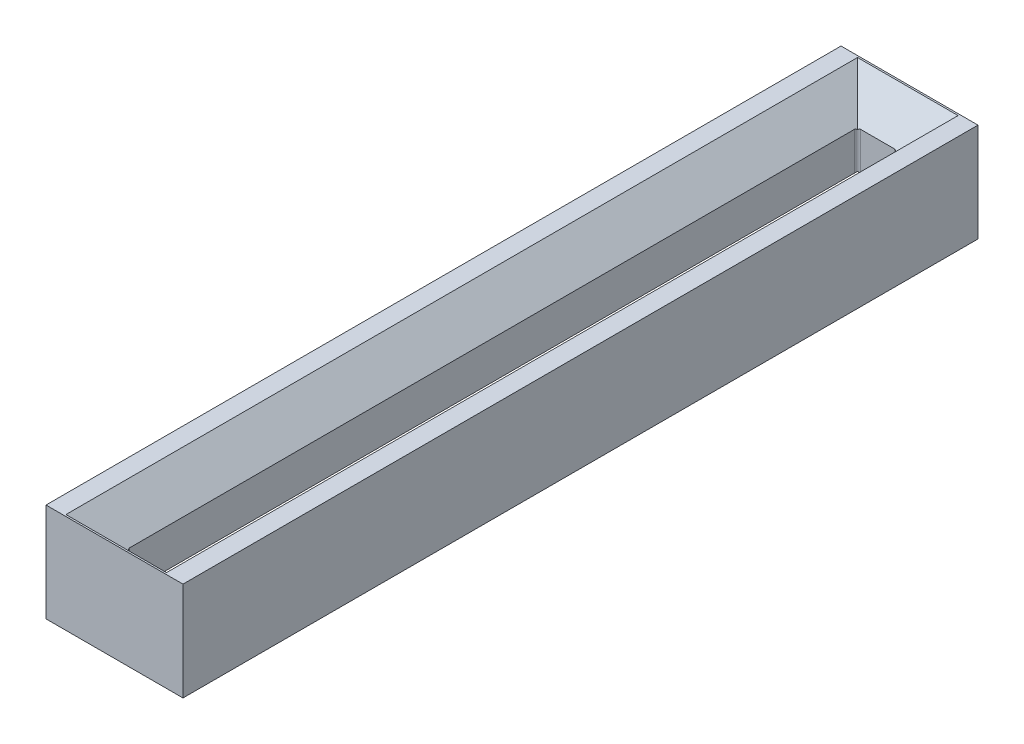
ISO-10303-21;
HEADER;
FILE_DESCRIPTION(('STEP AP214'),'2;1');
FILE_NAME('part.step','',(''),(''),'','','');
FILE_SCHEMA(('AUTOMOTIVE_DESIGN { 1 0 10303 214 1 1 1 1 }'));
ENDSEC;
DATA;
#1=APPLICATION_CONTEXT('core data for automotive mechanical design processes');
#2=APPLICATION_PROTOCOL_DEFINITION('international standard','automotive_design',2000,#1);
#3=PRODUCT_CONTEXT('',#1,'mechanical');
#4=PRODUCT('Part','Part','',(#3));
#5=PRODUCT_RELATED_PRODUCT_CATEGORY('part','',(#4));
#6=PRODUCT_DEFINITION_FORMATION('','',#4);
#7=PRODUCT_DEFINITION_CONTEXT('part definition',#1,'design');
#8=PRODUCT_DEFINITION('design','',#6,#7);
#9=PRODUCT_DEFINITION_SHAPE('','',#8);
#10=(LENGTH_UNIT() NAMED_UNIT(*) SI_UNIT(.MILLI.,.METRE.));
#11=(NAMED_UNIT(*) PLANE_ANGLE_UNIT() SI_UNIT($,.RADIAN.));
#12=(NAMED_UNIT(*) SI_UNIT($,.STERADIAN.) SOLID_ANGLE_UNIT());
#13=UNCERTAINTY_MEASURE_WITH_UNIT(LENGTH_MEASURE(1.E-05),#10,'distance_accuracy_value','');
#14=(GEOMETRIC_REPRESENTATION_CONTEXT(3) GLOBAL_UNCERTAINTY_ASSIGNED_CONTEXT((#13)) GLOBAL_UNIT_ASSIGNED_CONTEXT((#10,
#11,#12)) REPRESENTATION_CONTEXT('',''));
#15=CARTESIAN_POINT('',(0.,0.,0.));
#16=DIRECTION('',(0.,0.,1.));
#17=DIRECTION('',(1.,0.,0.));
#18=AXIS2_PLACEMENT_3D('',#15,#16,#17);
#19=CARTESIAN_POINT('',(0.,203.2,0.));
#20=DIRECTION('',(0.,1.,0.));
#21=DIRECTION('',(0.,0.,1.));
#22=AXIS2_PLACEMENT_3D('',#19,#20,#21);
#23=PLANE('',#22);
#24=DIRECTION('',(-1.,0.,0.));
#25=VECTOR('',#24,1.);
#26=CARTESIAN_POINT('',(432.769305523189,203.2,1638.));
#27=LINE('',#26,#25);
#28=CARTESIAN_POINT('',(282.224999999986,203.2,1638.));
#29=VERTEX_POINT('',#28);
#30=CARTESIAN_POINT('',(-282.225,203.2,1638.));
#31=VERTEX_POINT('',#30);
#32=EDGE_CURVE('E61',#29,#31,#27,.T.);
#33=ORIENTED_EDGE('',*,*,#32,.F.);
#34=DIRECTION('',(0.,0.,-1.));
#35=VECTOR('',#34,1.);
#36=CARTESIAN_POINT('',(282.224999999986,203.2,1706.025));
#37=LINE('',#36,#35);
#38=CARTESIAN_POINT('',(282.224999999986,203.2,-1638.));
#39=VERTEX_POINT('',#38);
#40=EDGE_CURVE('E199',#29,#39,#37,.T.);
#41=ORIENTED_EDGE('',*,*,#40,.T.);
#42=DIRECTION('',(1.,0.,0.));
#43=VECTOR('',#42,1.);
#44=CARTESIAN_POINT('',(432.769305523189,203.2,-1638.));
#45=LINE('',#44,#43);
#46=CARTESIAN_POINT('',(-282.225000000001,203.2,-1638.));
#47=VERTEX_POINT('',#46);
#48=EDGE_CURVE('E205',#47,#39,#45,.T.);
#49=ORIENTED_EDGE('',*,*,#48,.F.);
#50=DIRECTION('',(0.,0.,1.));
#51=VECTOR('',#50,1.);
#52=CARTESIAN_POINT('',(-282.225,203.2,1706.025));
#53=LINE('',#52,#51);
#54=EDGE_CURVE('E198',#47,#31,#53,.T.);
#55=ORIENTED_EDGE('',*,*,#54,.T.);
#56=EDGE_LOOP('',(#33,#41,#49,#55));
#57=FACE_BOUND('',#56,.T.);
#58=DIRECTION('',(1.,0.,0.));
#59=VECTOR('',#58,1.);
#60=CARTESIAN_POINT('',(0.,203.2,-1631.));
#61=LINE('',#60,#59);
#62=CARTESIAN_POINT('',(-207.2,203.2,-1631.));
#63=VERTEX_POINT('',#62);
#64=CARTESIAN_POINT('',(207.2,203.2,-1631.));
#65=VERTEX_POINT('',#64);
#66=EDGE_CURVE('E234',#63,#65,#61,.T.);
#67=ORIENTED_EDGE('',*,*,#66,.T.);
#68=DIRECTION('',(0.,0.,1.));
#69=VECTOR('',#68,1.);
#70=CARTESIAN_POINT('',(207.2,203.2,0.));
#71=LINE('',#70,#69);
#72=CARTESIAN_POINT('',(207.2,203.2,1631.));
#73=VERTEX_POINT('',#72);
#74=EDGE_CURVE('E240',#65,#73,#71,.T.);
#75=ORIENTED_EDGE('',*,*,#74,.T.);
#76=DIRECTION('',(-1.,0.,0.));
#77=VECTOR('',#76,1.);
#78=CARTESIAN_POINT('',(0.,203.2,1631.));
#79=LINE('',#78,#77);
#80=CARTESIAN_POINT('',(-207.2,203.2,1631.));
#81=VERTEX_POINT('',#80);
#82=EDGE_CURVE('E226',#73,#81,#79,.T.);
#83=ORIENTED_EDGE('',*,*,#82,.T.);
#84=DIRECTION('',(0.,0.,-1.));
#85=VECTOR('',#84,1.);
#86=CARTESIAN_POINT('',(-207.2,203.2,0.));
#87=LINE('',#86,#85);
#88=EDGE_CURVE('E233',#81,#63,#87,.T.);
#89=ORIENTED_EDGE('',*,*,#88,.T.);
#90=EDGE_LOOP('',(#67,#75,#83,#89));
#91=FACE_BOUND('',#90,.T.);
#92=ADVANCED_FACE('F46',(#57,#91),#23,.T.);
#93=CARTESIAN_POINT('',(0.,-203.2,0.));
#94=DIRECTION('',(0.,1.,0.));
#95=DIRECTION('',(0.,0.,1.));
#96=AXIS2_PLACEMENT_3D('',#93,#94,#95);
#97=PLANE('',#96);
#98=DIRECTION('',(0.,0.,-1.));
#99=VECTOR('',#98,1.);
#100=CARTESIAN_POINT('',(207.2,-203.2,-1506.));
#101=LINE('',#100,#99);
#102=CARTESIAN_POINT('',(207.2,-203.2,1631.));
#103=VERTEX_POINT('',#102);
#104=CARTESIAN_POINT('',(207.2,-203.2,-1631.));
#105=VERTEX_POINT('',#104);
#106=EDGE_CURVE('E272',#103,#105,#101,.T.);
#107=ORIENTED_EDGE('',*,*,#106,.T.);
#108=DIRECTION('',(-1.,0.,0.));
#109=VECTOR('',#108,1.);
#110=CARTESIAN_POINT('',(-82.1999999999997,-203.2,-1631.));
#111=LINE('',#110,#109);
#112=CARTESIAN_POINT('',(-207.2,-203.2,-1631.));
#113=VERTEX_POINT('',#112);
#114=EDGE_CURVE('E274',#105,#113,#111,.T.);
#115=ORIENTED_EDGE('',*,*,#114,.T.);
#116=DIRECTION('',(0.,0.,1.));
#117=VECTOR('',#116,1.);
#118=CARTESIAN_POINT('',(-207.2,-203.2,1506.));
#119=LINE('',#118,#117);
#120=CARTESIAN_POINT('',(-207.2,-203.2,1631.));
#121=VERTEX_POINT('',#120);
#122=EDGE_CURVE('E266',#113,#121,#119,.T.);
#123=ORIENTED_EDGE('',*,*,#122,.T.);
#124=DIRECTION('',(1.,0.,0.));
#125=VECTOR('',#124,1.);
#126=CARTESIAN_POINT('',(82.2000000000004,-203.2,1631.));
#127=LINE('',#126,#125);
#128=EDGE_CURVE('E263',#121,#103,#127,.T.);
#129=ORIENTED_EDGE('',*,*,#128,.T.);
#130=EDGE_LOOP('',(#107,#115,#123,#129));
#131=FACE_BOUND('',#130,.T.);
#132=DIRECTION('',(0.,0.,-1.));
#133=VECTOR('',#132,1.);
#134=CARTESIAN_POINT('',(282.224999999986,-203.2,1706.025));
#135=LINE('',#134,#133);
#136=CARTESIAN_POINT('',(282.224999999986,-203.2,1638.));
#137=VERTEX_POINT('',#136);
#138=CARTESIAN_POINT('',(282.224999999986,-203.2,-1638.));
#139=VERTEX_POINT('',#138);
#140=EDGE_CURVE('E213',#137,#139,#135,.T.);
#141=ORIENTED_EDGE('',*,*,#140,.F.);
#142=DIRECTION('',(-1.,0.,0.));
#143=VECTOR('',#142,1.);
#144=CARTESIAN_POINT('',(432.769305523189,-203.2,1638.));
#145=LINE('',#144,#143);
#146=CARTESIAN_POINT('',(-282.225,-203.2,1638.));
#147=VERTEX_POINT('',#146);
#148=EDGE_CURVE('E183',#137,#147,#145,.T.);
#149=ORIENTED_EDGE('',*,*,#148,.T.);
#150=DIRECTION('',(0.,0.,1.));
#151=VECTOR('',#150,1.);
#152=CARTESIAN_POINT('',(-282.225,-203.2,1706.025));
#153=LINE('',#152,#151);
#154=CARTESIAN_POINT('',(-282.225000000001,-203.2,-1638.));
#155=VERTEX_POINT('',#154);
#156=EDGE_CURVE('E210',#155,#147,#153,.T.);
#157=ORIENTED_EDGE('',*,*,#156,.F.);
#158=DIRECTION('',(1.,0.,0.));
#159=VECTOR('',#158,1.);
#160=CARTESIAN_POINT('',(432.769305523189,-203.2,-1638.));
#161=LINE('',#160,#159);
#162=EDGE_CURVE('E66',#155,#139,#161,.T.);
#163=ORIENTED_EDGE('',*,*,#162,.T.);
#164=EDGE_LOOP('',(#141,#149,#157,#163));
#165=FACE_BOUND('',#164,.T.);
#166=ADVANCED_FACE('F387',(#131,#165),#97,.F.);
#167=CARTESIAN_POINT('',(282.224999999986,203.2,1706.025));
#168=DIRECTION('',(-1.,0.,0.));
#169=DIRECTION('',(0.,0.,1.));
#170=AXIS2_PLACEMENT_3D('',#167,#168,#169);
#171=PLANE('',#170);
#172=ORIENTED_EDGE('',*,*,#40,.F.);
#173=DIRECTION('',(0.,-1.,0.));
#174=VECTOR('',#173,1.);
#175=CARTESIAN_POINT('',(282.224999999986,203.2,1638.));
#176=LINE('',#175,#174);
#177=EDGE_CURVE('E181',#29,#137,#176,.T.);
#178=ORIENTED_EDGE('',*,*,#177,.T.);
#179=ORIENTED_EDGE('',*,*,#140,.T.);
#180=DIRECTION('',(0.,1.,0.));
#181=VECTOR('',#180,1.);
#182=CARTESIAN_POINT('',(282.224999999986,203.2,-1638.));
#183=LINE('',#182,#181);
#184=EDGE_CURVE('E194',#139,#39,#183,.T.);
#185=ORIENTED_EDGE('',*,*,#184,.T.);
#186=EDGE_LOOP('',(#172,#178,#179,#185));
#187=FACE_BOUND('',#186,.T.);
#188=ADVANCED_FACE('F204',(#187),#171,.F.);
#189=CARTESIAN_POINT('',(-282.225,203.2,1706.025));
#190=DIRECTION('',(1.,0.,0.));
#191=DIRECTION('',(0.,0.,-1.));
#192=AXIS2_PLACEMENT_3D('',#189,#190,#191);
#193=PLANE('',#192);
#194=ORIENTED_EDGE('',*,*,#156,.T.);
#195=DIRECTION('',(0.,1.,0.));
#196=VECTOR('',#195,1.);
#197=CARTESIAN_POINT('',(-282.225,203.2,1638.));
#198=LINE('',#197,#196);
#199=EDGE_CURVE('E11',#147,#31,#198,.T.);
#200=ORIENTED_EDGE('',*,*,#199,.T.);
#201=ORIENTED_EDGE('',*,*,#54,.F.);
#202=DIRECTION('',(0.,-1.,0.));
#203=VECTOR('',#202,1.);
#204=CARTESIAN_POINT('',(-282.225000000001,203.2,-1638.));
#205=LINE('',#204,#203);
#206=EDGE_CURVE('E54',#47,#155,#205,.T.);
#207=ORIENTED_EDGE('',*,*,#206,.T.);
#208=EDGE_LOOP('',(#194,#200,#201,#207));
#209=FACE_BOUND('',#208,.T.);
#210=ADVANCED_FACE('F390',(#209),#193,.F.);
#211=CARTESIAN_POINT('',(-82.1999999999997,203.2,-1506.));
#212=DIRECTION('',(1.,0.,0.));
#213=DIRECTION('',(0.,0.,-1.));
#214=AXIS2_PLACEMENT_3D('',#211,#212,#213);
#215=PLANE('',#214);
#216=DIRECTION('',(0.,0.,1.));
#217=VECTOR('',#216,1.);
#218=CARTESIAN_POINT('',(-82.1999999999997,78.2000000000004,-1506.));
#219=LINE('',#218,#217);
#220=CARTESIAN_POINT('',(-82.1999999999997,78.2000000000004,-1493.));
#221=VERTEX_POINT('',#220);
#222=CARTESIAN_POINT('',(-82.1999999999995,78.2000000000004,1493.));
#223=VERTEX_POINT('',#222);
#224=EDGE_CURVE('E254',#221,#223,#219,.T.);
#225=ORIENTED_EDGE('',*,*,#224,.T.);
#226=DIRECTION('',(0.,-1.,0.));
#227=VECTOR('',#226,1.);
#228=CARTESIAN_POINT('',(-82.1999999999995,-78.1999999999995,1493.));
#229=LINE('',#228,#227);
#230=CARTESIAN_POINT('',(-82.1999999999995,-78.1999999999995,1493.));
#231=VERTEX_POINT('',#230);
#232=EDGE_CURVE('E316',#223,#231,#229,.T.);
#233=ORIENTED_EDGE('',*,*,#232,.T.);
#234=DIRECTION('',(0.,0.,-1.));
#235=VECTOR('',#234,1.);
#236=CARTESIAN_POINT('',(-82.1999999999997,-78.1999999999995,-1506.));
#237=LINE('',#236,#235);
#238=CARTESIAN_POINT('',(-82.1999999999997,-78.1999999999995,-1493.));
#239=VERTEX_POINT('',#238);
#240=EDGE_CURVE('E248',#231,#239,#237,.T.);
#241=ORIENTED_EDGE('',*,*,#240,.T.);
#242=DIRECTION('',(0.,-1.,0.));
#243=VECTOR('',#242,1.);
#244=CARTESIAN_POINT('',(-82.1999999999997,78.2000000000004,-1493.));
#245=LINE('',#244,#243);
#246=EDGE_CURVE('E317',#239,#221,#245,.F.);
#247=ORIENTED_EDGE('',*,*,#246,.T.);
#248=EDGE_LOOP('',(#225,#233,#241,#247));
#249=FACE_BOUND('',#248,.T.);
#250=ADVANCED_FACE('F416',(#249),#215,.T.);
#251=CARTESIAN_POINT('',(-82.1999999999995,203.2,1506.));
#252=DIRECTION('',(0.,0.,-1.));
#253=DIRECTION('',(-1.,0.,0.));
#254=AXIS2_PLACEMENT_3D('',#251,#252,#253);
#255=PLANE('',#254);
#256=DIRECTION('',(1.,0.,0.));
#257=VECTOR('',#256,1.);
#258=CARTESIAN_POINT('',(-82.1999999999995,78.2000000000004,1506.));
#259=LINE('',#258,#257);
#260=CARTESIAN_POINT('',(-69.1999999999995,78.2000000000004,1506.));
#261=VERTEX_POINT('',#260);
#262=CARTESIAN_POINT('',(69.2000000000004,78.2000000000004,1506.));
#263=VERTEX_POINT('',#262);
#264=EDGE_CURVE('E262',#261,#263,#259,.T.);
#265=ORIENTED_EDGE('',*,*,#264,.T.);
#266=DIRECTION('',(0.,-1.,0.));
#267=VECTOR('',#266,1.);
#268=CARTESIAN_POINT('',(69.2000000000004,-78.1999999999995,1506.));
#269=LINE('',#268,#267);
#270=CARTESIAN_POINT('',(69.2000000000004,-78.1999999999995,1506.));
#271=VERTEX_POINT('',#270);
#272=EDGE_CURVE('E304',#263,#271,#269,.T.);
#273=ORIENTED_EDGE('',*,*,#272,.T.);
#274=DIRECTION('',(-1.,0.,0.));
#275=VECTOR('',#274,1.);
#276=CARTESIAN_POINT('',(-82.1999999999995,-78.1999999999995,1506.));
#277=LINE('',#276,#275);
#278=CARTESIAN_POINT('',(-69.1999999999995,-78.1999999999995,1506.));
#279=VERTEX_POINT('',#278);
#280=EDGE_CURVE('E256',#271,#279,#277,.T.);
#281=ORIENTED_EDGE('',*,*,#280,.T.);
#282=DIRECTION('',(0.,-1.,0.));
#283=VECTOR('',#282,1.);
#284=CARTESIAN_POINT('',(-69.1999999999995,78.2000000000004,1506.));
#285=LINE('',#284,#283);
#286=EDGE_CURVE('E280',#279,#261,#285,.F.);
#287=ORIENTED_EDGE('',*,*,#286,.T.);
#288=EDGE_LOOP('',(#265,#273,#281,#287));
#289=FACE_BOUND('',#288,.T.);
#290=ADVANCED_FACE('F530',(#289),#255,.T.);
#291=CARTESIAN_POINT('',(82.2000000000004,203.2,1506.));
#292=DIRECTION('',(-1.,0.,0.));
#293=DIRECTION('',(0.,0.,1.));
#294=AXIS2_PLACEMENT_3D('',#291,#292,#293);
#295=PLANE('',#294);
#296=DIRECTION('',(0.,0.,1.));
#297=VECTOR('',#296,1.);
#298=CARTESIAN_POINT('',(82.2000000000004,-78.1999999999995,1506.));
#299=LINE('',#298,#297);
#300=CARTESIAN_POINT('',(82.2000000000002,-78.1999999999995,-1493.));
#301=VERTEX_POINT('',#300);
#302=CARTESIAN_POINT('',(82.2000000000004,-78.1999999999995,1493.));
#303=VERTEX_POINT('',#302);
#304=EDGE_CURVE('E214',#301,#303,#299,.T.);
#305=ORIENTED_EDGE('',*,*,#304,.T.);
#306=DIRECTION('',(0.,-1.,0.));
#307=VECTOR('',#306,1.);
#308=CARTESIAN_POINT('',(82.2000000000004,78.2000000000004,1493.));
#309=LINE('',#308,#307);
#310=CARTESIAN_POINT('',(82.2000000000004,78.2000000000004,1493.));
#311=VERTEX_POINT('',#310);
#312=EDGE_CURVE('E312',#303,#311,#309,.F.);
#313=ORIENTED_EDGE('',*,*,#312,.T.);
#314=DIRECTION('',(0.,0.,-1.));
#315=VECTOR('',#314,1.);
#316=CARTESIAN_POINT('',(82.2000000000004,78.2000000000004,1506.));
#317=LINE('',#316,#315);
#318=CARTESIAN_POINT('',(82.2000000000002,78.2000000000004,-1493.));
#319=VERTEX_POINT('',#318);
#320=EDGE_CURVE('E222',#311,#319,#317,.T.);
#321=ORIENTED_EDGE('',*,*,#320,.T.);
#322=DIRECTION('',(0.,-1.,0.));
#323=VECTOR('',#322,1.);
#324=CARTESIAN_POINT('',(82.2000000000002,-78.1999999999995,-1493.));
#325=LINE('',#324,#323);
#326=EDGE_CURVE('E307',#319,#301,#325,.T.);
#327=ORIENTED_EDGE('',*,*,#326,.T.);
#328=EDGE_LOOP('',(#305,#313,#321,#327));
#329=FACE_BOUND('',#328,.T.);
#330=ADVANCED_FACE('F536',(#329),#295,.T.);
#331=CARTESIAN_POINT('',(82.2000000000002,203.2,-1506.));
#332=DIRECTION('',(0.,0.,1.));
#333=DIRECTION('',(1.,0.,0.));
#334=AXIS2_PLACEMENT_3D('',#331,#332,#333);
#335=PLANE('',#334);
#336=DIRECTION('',(-1.,0.,0.));
#337=VECTOR('',#336,1.);
#338=CARTESIAN_POINT('',(82.2000000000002,78.2000000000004,-1506.));
#339=LINE('',#338,#337);
#340=CARTESIAN_POINT('',(69.2000000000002,78.2000000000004,-1506.));
#341=VERTEX_POINT('',#340);
#342=CARTESIAN_POINT('',(-69.1999999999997,78.2000000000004,-1506.));
#343=VERTEX_POINT('',#342);
#344=EDGE_CURVE('E244',#341,#343,#339,.T.);
#345=ORIENTED_EDGE('',*,*,#344,.T.);
#346=DIRECTION('',(0.,-1.,0.));
#347=VECTOR('',#346,1.);
#348=CARTESIAN_POINT('',(-69.1999999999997,-78.1999999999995,-1506.));
#349=LINE('',#348,#347);
#350=CARTESIAN_POINT('',(-69.1999999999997,-78.1999999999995,-1506.));
#351=VERTEX_POINT('',#350);
#352=EDGE_CURVE('E327',#343,#351,#349,.T.);
#353=ORIENTED_EDGE('',*,*,#352,.T.);
#354=DIRECTION('',(1.,0.,0.));
#355=VECTOR('',#354,1.);
#356=CARTESIAN_POINT('',(82.2000000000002,-78.1999999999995,-1506.));
#357=LINE('',#356,#355);
#358=CARTESIAN_POINT('',(69.2000000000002,-78.1999999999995,-1506.));
#359=VERTEX_POINT('',#358);
#360=EDGE_CURVE('E241',#351,#359,#357,.T.);
#361=ORIENTED_EDGE('',*,*,#360,.T.);
#362=DIRECTION('',(0.,-1.,0.));
#363=VECTOR('',#362,1.);
#364=CARTESIAN_POINT('',(69.2000000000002,78.2000000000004,-1506.));
#365=LINE('',#364,#363);
#366=EDGE_CURVE('E325',#359,#341,#365,.F.);
#367=ORIENTED_EDGE('',*,*,#366,.T.);
#368=EDGE_LOOP('',(#345,#353,#361,#367));
#369=FACE_BOUND('',#368,.T.);
#370=ADVANCED_FACE('F455',(#369),#335,.T.);
#371=CARTESIAN_POINT('',(-82.1999999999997,78.2000000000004,-1506.));
#372=DIRECTION('',(-0.707106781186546,-0.707106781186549,0.));
#373=DIRECTION('',(0.,0.,1.));
#374=AXIS2_PLACEMENT_3D('',#371,#372,#373);
#375=PLANE('',#374);
#376=DIRECTION('',(-0.577350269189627,0.577350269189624,-0.577350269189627));
#377=VECTOR('',#376,1.);
#378=CARTESIAN_POINT('',(-27.3999999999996,23.4000000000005,-1451.2));
#379=LINE('',#378,#377);
#380=CARTESIAN_POINT('',(-78.3923881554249,74.3923881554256,-1502.19238815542));
#381=VERTEX_POINT('',#380);
#382=EDGE_CURVE('E288',#63,#381,#379,.F.);
#383=ORIENTED_EDGE('',*,*,#382,.F.);
#384=ORIENTED_EDGE('',*,*,#88,.F.);
#385=DIRECTION('',(-0.577350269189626,0.577350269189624,0.577350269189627));
#386=VECTOR('',#385,1.);
#387=CARTESIAN_POINT('',(921.800000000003,-925.799999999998,502.));
#388=LINE('',#387,#386);
#389=CARTESIAN_POINT('',(-78.3923881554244,74.3923881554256,1502.19238815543));
#390=VERTEX_POINT('',#389);
#391=EDGE_CURVE('E216',#390,#81,#388,.T.);
#392=ORIENTED_EDGE('',*,*,#391,.F.);
#393=CARTESIAN_POINT('',(-69.1999999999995,65.2000000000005,1493.));
#394=DIRECTION('',(-0.707106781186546,-0.707106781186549,0.));
#395=DIRECTION('',(-0.707106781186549,0.707106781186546,0.));
#396=AXIS2_PLACEMENT_3D('',#393,#394,#395);
#397=ELLIPSE('',#396,18.3847763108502,13.);
#398=EDGE_CURVE('E354',#390,#223,#397,.T.);
#399=ORIENTED_EDGE('',*,*,#398,.T.);
#400=ORIENTED_EDGE('',*,*,#224,.F.);
#401=CARTESIAN_POINT('',(-69.1999999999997,65.2000000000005,-1493.));
#402=DIRECTION('',(-0.707106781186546,-0.707106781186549,0.));
#403=DIRECTION('',(-0.707106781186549,0.707106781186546,0.));
#404=AXIS2_PLACEMENT_3D('',#401,#402,#403);
#405=ELLIPSE('',#404,18.3847763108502,13.);
#406=EDGE_CURVE('E362',#221,#381,#405,.T.);
#407=ORIENTED_EDGE('',*,*,#406,.T.);
#408=EDGE_LOOP('',(#383,#384,#392,#399,#400,#407));
#409=FACE_BOUND('',#408,.T.);
#410=ADVANCED_FACE('F450',(#409),#375,.F.);
#411=CARTESIAN_POINT('',(-82.1999999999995,78.2000000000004,1506.));
#412=DIRECTION('',(0.,-0.707106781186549,0.707106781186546));
#413=DIRECTION('',(1.,0.,0.));
#414=AXIS2_PLACEMENT_3D('',#411,#412,#413);
#415=PLANE('',#414);
#416=ORIENTED_EDGE('',*,*,#391,.T.);
#417=ORIENTED_EDGE('',*,*,#82,.F.);
#418=DIRECTION('',(-0.577350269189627,-0.577350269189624,-0.577350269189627));
#419=VECTOR('',#418,1.);
#420=CARTESIAN_POINT('',(82.2000000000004,78.2000000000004,1506.));
#421=LINE('',#420,#419);
#422=CARTESIAN_POINT('',(78.3923881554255,74.3923881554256,1502.19238815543));
#423=VERTEX_POINT('',#422);
#424=EDGE_CURVE('E285',#423,#73,#421,.F.);
#425=ORIENTED_EDGE('',*,*,#424,.F.);
#426=CARTESIAN_POINT('',(69.2000000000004,65.2000000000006,1493.));
#427=DIRECTION('',(0.,-0.707106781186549,0.707106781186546));
#428=DIRECTION('',(0.,0.707106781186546,0.707106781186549));
#429=AXIS2_PLACEMENT_3D('',#426,#427,#428);
#430=ELLIPSE('',#429,18.3847763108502,13.);
#431=EDGE_CURVE('E344',#423,#263,#430,.T.);
#432=ORIENTED_EDGE('',*,*,#431,.T.);
#433=ORIENTED_EDGE('',*,*,#264,.F.);
#434=CARTESIAN_POINT('',(-69.1999999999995,65.2000000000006,1493.));
#435=DIRECTION('',(0.,-0.707106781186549,0.707106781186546));
#436=DIRECTION('',(0.,0.707106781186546,0.707106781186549));
#437=AXIS2_PLACEMENT_3D('',#434,#435,#436);
#438=ELLIPSE('',#437,18.3847763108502,13.);
#439=EDGE_CURVE('E353',#261,#390,#438,.T.);
#440=ORIENTED_EDGE('',*,*,#439,.T.);
#441=EDGE_LOOP('',(#416,#417,#425,#432,#433,#440));
#442=FACE_BOUND('',#441,.T.);
#443=ADVANCED_FACE('F439',(#442),#415,.F.);
#444=CARTESIAN_POINT('',(82.2000000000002,78.2000000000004,-1506.));
#445=DIRECTION('',(0.,-0.707106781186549,-0.707106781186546));
#446=DIRECTION('',(-1.,0.,0.));
#447=AXIS2_PLACEMENT_3D('',#444,#445,#446);
#448=PLANE('',#447);
#449=ORIENTED_EDGE('',*,*,#382,.T.);
#450=CARTESIAN_POINT('',(-69.1999999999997,65.2000000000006,-1493.));
#451=DIRECTION('',(0.,-0.707106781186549,-0.707106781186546));
#452=DIRECTION('',(0.,0.707106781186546,-0.707106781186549));
#453=AXIS2_PLACEMENT_3D('',#450,#451,#452);
#454=ELLIPSE('',#453,18.3847763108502,13.);
#455=EDGE_CURVE('E367',#381,#343,#454,.T.);
#456=ORIENTED_EDGE('',*,*,#455,.T.);
#457=ORIENTED_EDGE('',*,*,#344,.F.);
#458=CARTESIAN_POINT('',(69.2000000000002,65.2000000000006,-1493.));
#459=DIRECTION('',(0.,-0.707106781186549,-0.707106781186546));
#460=DIRECTION('',(0.,0.707106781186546,-0.707106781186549));
#461=AXIS2_PLACEMENT_3D('',#458,#459,#460);
#462=ELLIPSE('',#461,18.3847763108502,13.);
#463=CARTESIAN_POINT('',(78.392388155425,74.3923881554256,-1502.19238815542));
#464=VERTEX_POINT('',#463);
#465=EDGE_CURVE('E378',#341,#464,#462,.T.);
#466=ORIENTED_EDGE('',*,*,#465,.T.);
#467=DIRECTION('',(0.577350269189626,0.577350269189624,-0.577350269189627));
#468=VECTOR('',#467,1.);
#469=CARTESIAN_POINT('',(-921.800000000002,-925.799999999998,-501.999999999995));
#470=LINE('',#469,#468);
#471=EDGE_CURVE('E278',#65,#464,#470,.F.);
#472=ORIENTED_EDGE('',*,*,#471,.F.);
#473=ORIENTED_EDGE('',*,*,#66,.F.);
#474=EDGE_LOOP('',(#449,#456,#457,#466,#472,#473));
#475=FACE_BOUND('',#474,.T.);
#476=ADVANCED_FACE('F433',(#475),#448,.F.);
#477=CARTESIAN_POINT('',(82.2000000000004,78.2000000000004,1506.));
#478=DIRECTION('',(0.707106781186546,-0.707106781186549,0.));
#479=DIRECTION('',(0.,0.,-1.));
#480=AXIS2_PLACEMENT_3D('',#477,#478,#479);
#481=PLANE('',#480);
#482=ORIENTED_EDGE('',*,*,#424,.T.);
#483=ORIENTED_EDGE('',*,*,#74,.F.);
#484=ORIENTED_EDGE('',*,*,#471,.T.);
#485=CARTESIAN_POINT('',(69.2000000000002,65.2000000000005,-1493.));
#486=DIRECTION('',(0.707106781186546,-0.707106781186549,0.));
#487=DIRECTION('',(0.707106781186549,0.707106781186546,0.));
#488=AXIS2_PLACEMENT_3D('',#485,#486,#487);
#489=ELLIPSE('',#488,18.3847763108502,13.);
#490=EDGE_CURVE('E384',#464,#319,#489,.T.);
#491=ORIENTED_EDGE('',*,*,#490,.T.);
#492=ORIENTED_EDGE('',*,*,#320,.F.);
#493=CARTESIAN_POINT('',(69.2000000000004,65.2000000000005,1493.));
#494=DIRECTION('',(0.707106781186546,-0.707106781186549,0.));
#495=DIRECTION('',(0.707106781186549,0.707106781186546,0.));
#496=AXIS2_PLACEMENT_3D('',#493,#494,#495);
#497=ELLIPSE('',#496,18.3847763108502,13.);
#498=EDGE_CURVE('E340',#311,#423,#497,.T.);
#499=ORIENTED_EDGE('',*,*,#498,.T.);
#500=EDGE_LOOP('',(#482,#483,#484,#491,#492,#499));
#501=FACE_BOUND('',#500,.T.);
#502=ADVANCED_FACE('F424',(#501),#481,.F.);
#503=CARTESIAN_POINT('',(0.,-203.2,1631.));
#504=DIRECTION('',(0.,-0.707106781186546,-0.707106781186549));
#505=DIRECTION('',(-1.,0.,0.));
#506=AXIS2_PLACEMENT_3D('',#503,#504,#505);
#507=PLANE('',#506);
#508=DIRECTION('',(0.577350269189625,0.577350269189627,-0.577350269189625));
#509=VECTOR('',#508,1.);
#510=CARTESIAN_POINT('',(336.466666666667,340.466666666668,1087.33333333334));
#511=LINE('',#510,#509);
#512=CARTESIAN_POINT('',(-78.3923881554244,-74.3923881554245,1502.19238815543));
#513=VERTEX_POINT('',#512);
#514=EDGE_CURVE('E300',#513,#121,#511,.F.);
#515=ORIENTED_EDGE('',*,*,#514,.F.);
#516=CARTESIAN_POINT('',(-69.1999999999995,-65.1999999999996,1493.));
#517=DIRECTION('',(0.,-0.707106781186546,-0.707106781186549));
#518=DIRECTION('',(0.,0.707106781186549,-0.707106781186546));
#519=AXIS2_PLACEMENT_3D('',#516,#517,#518);
#520=ELLIPSE('',#519,18.3847763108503,13.);
#521=EDGE_CURVE('E349',#513,#279,#520,.F.);
#522=ORIENTED_EDGE('',*,*,#521,.T.);
#523=ORIENTED_EDGE('',*,*,#280,.F.);
#524=CARTESIAN_POINT('',(69.2000000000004,-65.1999999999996,1493.));
#525=DIRECTION('',(0.,-0.707106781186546,-0.707106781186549));
#526=DIRECTION('',(0.,0.707106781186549,-0.707106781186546));
#527=AXIS2_PLACEMENT_3D('',#524,#525,#526);
#528=ELLIPSE('',#527,18.3847763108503,13.);
#529=CARTESIAN_POINT('',(78.3923881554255,-74.3923881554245,1502.19238815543));
#530=VERTEX_POINT('',#529);
#531=EDGE_CURVE('E328',#271,#530,#528,.F.);
#532=ORIENTED_EDGE('',*,*,#531,.T.);
#533=DIRECTION('',(0.577350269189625,-0.577350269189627,0.577350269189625));
#534=VECTOR('',#533,1.);
#535=CARTESIAN_POINT('',(-336.466666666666,340.466666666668,1087.33333333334));
#536=LINE('',#535,#534);
#537=EDGE_CURVE('E284',#103,#530,#536,.F.);
#538=ORIENTED_EDGE('',*,*,#537,.F.);
#539=ORIENTED_EDGE('',*,*,#128,.F.);
#540=EDGE_LOOP('',(#515,#522,#523,#532,#538,#539));
#541=FACE_BOUND('',#540,.T.);
#542=ADVANCED_FACE('F435',(#541),#507,.T.);
#543=CARTESIAN_POINT('',(207.2,-203.2,0.));
#544=DIRECTION('',(-0.707106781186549,-0.707106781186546,0.));
#545=DIRECTION('',(0.,0.,1.));
#546=AXIS2_PLACEMENT_3D('',#543,#544,#545);
#547=PLANE('',#546);
#548=ORIENTED_EDGE('',*,*,#537,.T.);
#549=CARTESIAN_POINT('',(69.2000000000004,-65.1999999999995,1493.));
#550=DIRECTION('',(-0.707106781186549,-0.707106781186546,0.));
#551=DIRECTION('',(-0.707106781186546,0.707106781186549,0.));
#552=AXIS2_PLACEMENT_3D('',#549,#550,#551);
#553=ELLIPSE('',#552,18.3847763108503,13.);
#554=EDGE_CURVE('E332',#530,#303,#553,.F.);
#555=ORIENTED_EDGE('',*,*,#554,.T.);
#556=ORIENTED_EDGE('',*,*,#304,.F.);
#557=CARTESIAN_POINT('',(69.2000000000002,-65.1999999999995,-1493.));
#558=DIRECTION('',(-0.707106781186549,-0.707106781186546,0.));
#559=DIRECTION('',(-0.707106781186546,0.707106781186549,0.));
#560=AXIS2_PLACEMENT_3D('',#557,#558,#559);
#561=ELLIPSE('',#560,18.3847763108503,13.);
#562=CARTESIAN_POINT('',(78.3923881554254,-74.3923881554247,-1502.19238815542));
#563=VERTEX_POINT('',#562);
#564=EDGE_CURVE('E375',#301,#563,#561,.F.);
#565=ORIENTED_EDGE('',*,*,#564,.T.);
#566=DIRECTION('',(0.577350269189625,-0.577350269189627,-0.577350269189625));
#567=VECTOR('',#566,1.);
#568=CARTESIAN_POINT('',(138.133333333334,-134.133333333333,-1561.93333333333));
#569=LINE('',#568,#567);
#570=EDGE_CURVE('E295',#105,#563,#569,.F.);
#571=ORIENTED_EDGE('',*,*,#570,.F.);
#572=ORIENTED_EDGE('',*,*,#106,.F.);
#573=EDGE_LOOP('',(#548,#555,#556,#565,#571,#572));
#574=FACE_BOUND('',#573,.T.);
#575=ADVANCED_FACE('F468',(#574),#547,.T.);
#576=CARTESIAN_POINT('',(-207.2,-203.2,0.));
#577=DIRECTION('',(0.707106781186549,-0.707106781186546,0.));
#578=DIRECTION('',(0.,0.,-1.));
#579=AXIS2_PLACEMENT_3D('',#576,#577,#578);
#580=PLANE('',#579);
#581=ORIENTED_EDGE('',*,*,#514,.T.);
#582=ORIENTED_EDGE('',*,*,#122,.F.);
#583=DIRECTION('',(0.577350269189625,0.577350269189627,0.577350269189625));
#584=VECTOR('',#583,1.);
#585=CARTESIAN_POINT('',(-138.133333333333,-134.133333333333,-1561.93333333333));
#586=LINE('',#585,#584);
#587=CARTESIAN_POINT('',(-78.3923881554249,-74.3923881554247,-1502.19238815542));
#588=VERTEX_POINT('',#587);
#589=EDGE_CURVE('E188',#588,#113,#586,.F.);
#590=ORIENTED_EDGE('',*,*,#589,.F.);
#591=CARTESIAN_POINT('',(-69.1999999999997,-65.1999999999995,-1493.));
#592=DIRECTION('',(0.707106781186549,-0.707106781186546,0.));
#593=DIRECTION('',(0.707106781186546,0.707106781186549,0.));
#594=AXIS2_PLACEMENT_3D('',#591,#592,#593);
#595=ELLIPSE('',#594,18.3847763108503,13.);
#596=EDGE_CURVE('E365',#588,#239,#595,.F.);
#597=ORIENTED_EDGE('',*,*,#596,.T.);
#598=ORIENTED_EDGE('',*,*,#240,.F.);
#599=CARTESIAN_POINT('',(-69.1999999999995,-65.1999999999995,1493.));
#600=DIRECTION('',(0.707106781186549,-0.707106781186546,0.));
#601=DIRECTION('',(0.707106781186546,0.707106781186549,0.));
#602=AXIS2_PLACEMENT_3D('',#599,#600,#601);
#603=ELLIPSE('',#602,18.3847763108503,13.);
#604=EDGE_CURVE('E343',#231,#513,#603,.F.);
#605=ORIENTED_EDGE('',*,*,#604,.T.);
#606=EDGE_LOOP('',(#581,#582,#590,#597,#598,#605));
#607=FACE_BOUND('',#606,.T.);
#608=ADVANCED_FACE('F461',(#607),#580,.T.);
#609=CARTESIAN_POINT('',(0.,-203.2,-1631.));
#610=DIRECTION('',(0.,-0.707106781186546,0.707106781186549));
#611=DIRECTION('',(1.,0.,0.));
#612=AXIS2_PLACEMENT_3D('',#609,#610,#611);
#613=PLANE('',#612);
#614=ORIENTED_EDGE('',*,*,#570,.T.);
#615=CARTESIAN_POINT('',(69.2000000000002,-65.1999999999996,-1493.));
#616=DIRECTION('',(0.,-0.707106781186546,0.707106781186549));
#617=DIRECTION('',(0.,0.707106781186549,0.707106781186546));
#618=AXIS2_PLACEMENT_3D('',#615,#616,#617);
#619=ELLIPSE('',#618,18.3847763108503,13.);
#620=EDGE_CURVE('E376',#563,#359,#619,.F.);
#621=ORIENTED_EDGE('',*,*,#620,.T.);
#622=ORIENTED_EDGE('',*,*,#360,.F.);
#623=CARTESIAN_POINT('',(-69.1999999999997,-65.1999999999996,-1493.));
#624=DIRECTION('',(0.,-0.707106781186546,0.707106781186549));
#625=DIRECTION('',(0.,0.707106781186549,0.707106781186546));
#626=AXIS2_PLACEMENT_3D('',#623,#624,#625);
#627=ELLIPSE('',#626,18.3847763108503,13.);
#628=EDGE_CURVE('E356',#351,#588,#627,.F.);
#629=ORIENTED_EDGE('',*,*,#628,.T.);
#630=ORIENTED_EDGE('',*,*,#589,.T.);
#631=ORIENTED_EDGE('',*,*,#114,.F.);
#632=EDGE_LOOP('',(#614,#621,#622,#629,#630,#631));
#633=FACE_BOUND('',#632,.T.);
#634=ADVANCED_FACE('F457',(#633),#613,.T.);
#635=CARTESIAN_POINT('',(69.2000000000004,203.2,1493.));
#636=DIRECTION('',(0.,1.,0.));
#637=DIRECTION('',(0.,0.,1.));
#638=AXIS2_PLACEMENT_3D('',#635,#636,#637);
#639=CYLINDRICAL_SURFACE('',#638,13.);
#640=ORIENTED_EDGE('',*,*,#498,.F.);
#641=ORIENTED_EDGE('',*,*,#312,.F.);
#642=ORIENTED_EDGE('',*,*,#554,.F.);
#643=ORIENTED_EDGE('',*,*,#531,.F.);
#644=ORIENTED_EDGE('',*,*,#272,.F.);
#645=ORIENTED_EDGE('',*,*,#431,.F.);
#646=EDGE_LOOP('',(#640,#641,#642,#643,#644,#645));
#647=FACE_BOUND('',#646,.T.);
#648=ADVANCED_FACE('F465',(#647),#639,.F.);
#649=CARTESIAN_POINT('',(-69.1999999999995,203.2,1493.));
#650=DIRECTION('',(0.,1.,0.));
#651=DIRECTION('',(0.,0.,1.));
#652=AXIS2_PLACEMENT_3D('',#649,#650,#651);
#653=CYLINDRICAL_SURFACE('',#652,13.);
#654=ORIENTED_EDGE('',*,*,#439,.F.);
#655=ORIENTED_EDGE('',*,*,#286,.F.);
#656=ORIENTED_EDGE('',*,*,#521,.F.);
#657=ORIENTED_EDGE('',*,*,#604,.F.);
#658=ORIENTED_EDGE('',*,*,#232,.F.);
#659=ORIENTED_EDGE('',*,*,#398,.F.);
#660=EDGE_LOOP('',(#654,#655,#656,#657,#658,#659));
#661=FACE_BOUND('',#660,.T.);
#662=ADVANCED_FACE('F482',(#661),#653,.F.);
#663=CARTESIAN_POINT('',(-69.1999999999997,203.2,-1493.));
#664=DIRECTION('',(0.,1.,0.));
#665=DIRECTION('',(0.,0.,1.));
#666=AXIS2_PLACEMENT_3D('',#663,#664,#665);
#667=CYLINDRICAL_SURFACE('',#666,13.);
#668=ORIENTED_EDGE('',*,*,#406,.F.);
#669=ORIENTED_EDGE('',*,*,#246,.F.);
#670=ORIENTED_EDGE('',*,*,#596,.F.);
#671=ORIENTED_EDGE('',*,*,#628,.F.);
#672=ORIENTED_EDGE('',*,*,#352,.F.);
#673=ORIENTED_EDGE('',*,*,#455,.F.);
#674=EDGE_LOOP('',(#668,#669,#670,#671,#672,#673));
#675=FACE_BOUND('',#674,.T.);
#676=ADVANCED_FACE('F406',(#675),#667,.F.);
#677=CARTESIAN_POINT('',(69.2000000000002,203.2,-1493.));
#678=DIRECTION('',(0.,1.,0.));
#679=DIRECTION('',(0.,0.,1.));
#680=AXIS2_PLACEMENT_3D('',#677,#678,#679);
#681=CYLINDRICAL_SURFACE('',#680,13.);
#682=ORIENTED_EDGE('',*,*,#465,.F.);
#683=ORIENTED_EDGE('',*,*,#366,.F.);
#684=ORIENTED_EDGE('',*,*,#620,.F.);
#685=ORIENTED_EDGE('',*,*,#564,.F.);
#686=ORIENTED_EDGE('',*,*,#326,.F.);
#687=ORIENTED_EDGE('',*,*,#490,.F.);
#688=EDGE_LOOP('',(#682,#683,#684,#685,#686,#687));
#689=FACE_BOUND('',#688,.T.);
#690=ADVANCED_FACE('F48',(#689),#681,.F.);
#691=CARTESIAN_POINT('',(432.769305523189,-203.2,-1638.));
#692=DIRECTION('',(0.,0.,1.));
#693=DIRECTION('',(1.,0.,0.));
#694=AXIS2_PLACEMENT_3D('',#691,#692,#693);
#695=PLANE('',#694);
#696=ORIENTED_EDGE('',*,*,#162,.F.);
#697=ORIENTED_EDGE('',*,*,#206,.F.);
#698=ORIENTED_EDGE('',*,*,#48,.T.);
#699=ORIENTED_EDGE('',*,*,#184,.F.);
#700=EDGE_LOOP('',(#696,#697,#698,#699));
#701=FACE_BOUND('',#700,.T.);
#702=ADVANCED_FACE('F396',(#701),#695,.F.);
#703=CARTESIAN_POINT('',(432.769305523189,-203.2,1638.));
#704=DIRECTION('',(0.,0.,-1.));
#705=DIRECTION('',(-1.,0.,0.));
#706=AXIS2_PLACEMENT_3D('',#703,#704,#705);
#707=PLANE('',#706);
#708=ORIENTED_EDGE('',*,*,#32,.T.);
#709=ORIENTED_EDGE('',*,*,#199,.F.);
#710=ORIENTED_EDGE('',*,*,#148,.F.);
#711=ORIENTED_EDGE('',*,*,#177,.F.);
#712=EDGE_LOOP('',(#708,#709,#710,#711));
#713=FACE_BOUND('',#712,.T.);
#714=ADVANCED_FACE('F185',(#713),#707,.F.);
#715=CLOSED_SHELL('',(#92,#166,#188,#210,#250,#290,#330,#370,#410,#443,#476,#502,#542,#575,#608,
#634,#648,#662,#676,#690,#702,#714));
#716=MANIFOLD_SOLID_BREP('B2',#715);
#717=ADVANCED_BREP_SHAPE_REPRESENTATION('',(#18,#716),#14);
#718=SHAPE_DEFINITION_REPRESENTATION(#9,#717);
ENDSEC;
END-ISO-10303-21;
